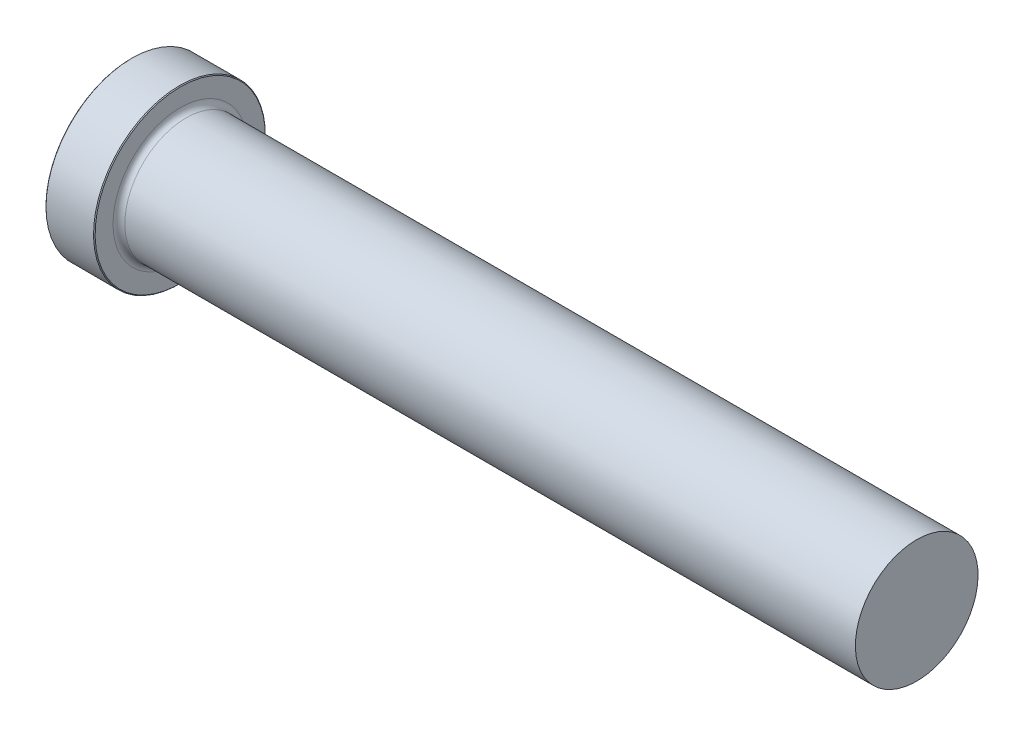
ISO-10303-21;
HEADER;
FILE_DESCRIPTION(('STEP AP214'),'2;1');
FILE_NAME('part.step','',(''),(''),'','','');
FILE_SCHEMA(('AUTOMOTIVE_DESIGN { 1 0 10303 214 1 1 1 1 }'));
ENDSEC;
DATA;
#1=APPLICATION_CONTEXT('core data for automotive mechanical design processes');
#2=APPLICATION_PROTOCOL_DEFINITION('international standard','automotive_design',2000,#1);
#3=PRODUCT_CONTEXT('',#1,'mechanical');
#4=PRODUCT('Part','Part','',(#3));
#5=PRODUCT_RELATED_PRODUCT_CATEGORY('part','',(#4));
#6=PRODUCT_DEFINITION_FORMATION('','',#4);
#7=PRODUCT_DEFINITION_CONTEXT('part definition',#1,'design');
#8=PRODUCT_DEFINITION('design','',#6,#7);
#9=PRODUCT_DEFINITION_SHAPE('','',#8);
#10=(LENGTH_UNIT() NAMED_UNIT(*) SI_UNIT(.MILLI.,.METRE.));
#11=(NAMED_UNIT(*) PLANE_ANGLE_UNIT() SI_UNIT($,.RADIAN.));
#12=(NAMED_UNIT(*) SI_UNIT($,.STERADIAN.) SOLID_ANGLE_UNIT());
#13=UNCERTAINTY_MEASURE_WITH_UNIT(LENGTH_MEASURE(1.E-05),#10,'distance_accuracy_value','');
#14=(GEOMETRIC_REPRESENTATION_CONTEXT(3) GLOBAL_UNCERTAINTY_ASSIGNED_CONTEXT((#13)) GLOBAL_UNIT_ASSIGNED_CONTEXT((#10,
#11,#12)) REPRESENTATION_CONTEXT('',''));
#15=CARTESIAN_POINT('',(0.,0.,0.));
#16=DIRECTION('',(0.,0.,1.));
#17=DIRECTION('',(1.,0.,0.));
#18=AXIS2_PLACEMENT_3D('',#15,#16,#17);
#19=CARTESIAN_POINT('',(101.6,7.93114999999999,0.));
#20=DIRECTION('',(1.,0.,0.));
#21=DIRECTION('',(0.,1.,0.));
#22=AXIS2_PLACEMENT_3D('',#19,#20,#21);
#23=PLANE('',#22);
#24=CARTESIAN_POINT('',(101.6,0.,0.));
#25=DIRECTION('',(1.,0.,0.));
#26=DIRECTION('',(0.,1.,0.));
#27=AXIS2_PLACEMENT_3D('',#24,#25,#26);
#28=CIRCLE('',#27,7.93115);
#29=CARTESIAN_POINT('',(101.6,7.93114999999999,0.));
#30=VERTEX_POINT('',#29);
#31=EDGE_CURVE('E50',#30,#30,#28,.T.);
#32=ORIENTED_EDGE('',*,*,#31,.T.);
#33=EDGE_LOOP('',(#32));
#34=FACE_BOUND('',#33,.T.);
#35=ADVANCED_FACE('F30',(#34),#23,.T.);
#36=CARTESIAN_POINT('',(101.6,0.,0.));
#37=DIRECTION('',(1.,0.,0.));
#38=DIRECTION('',(0.,1.,0.));
#39=AXIS2_PLACEMENT_3D('',#36,#37,#38);
#40=CYLINDRICAL_SURFACE('',#39,7.93115);
#41=CARTESIAN_POINT('',(7.11199999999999,0.,0.));
#42=DIRECTION('',(1.,0.,0.));
#43=DIRECTION('',(0.,1.,0.));
#44=AXIS2_PLACEMENT_3D('',#41,#42,#43);
#45=CIRCLE('',#44,7.93115);
#46=CARTESIAN_POINT('',(7.11199999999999,7.93115,0.));
#47=VERTEX_POINT('',#46);
#48=EDGE_CURVE('E53',#47,#47,#45,.T.);
#49=ORIENTED_EDGE('',*,*,#48,.T.);
#50=EDGE_LOOP('',(#49));
#51=FACE_BOUND('',#50,.T.);
#52=ORIENTED_EDGE('',*,*,#31,.F.);
#53=EDGE_LOOP('',(#52));
#54=FACE_BOUND('',#53,.T.);
#55=ADVANCED_FACE('F74',(#51,#54),#40,.T.);
#56=CARTESIAN_POINT('',(7.112,0.,0.));
#57=DIRECTION('',(1.,0.,0.));
#58=DIRECTION('',(0.,1.,0.));
#59=AXIS2_PLACEMENT_3D('',#56,#57,#58);
#60=TOROIDAL_SURFACE('',#59,8.69315,0.761999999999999);
#61=CARTESIAN_POINT('',(6.34999999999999,0.,0.));
#62=DIRECTION('',(1.,0.,0.));
#63=DIRECTION('',(0.,1.,0.));
#64=AXIS2_PLACEMENT_3D('',#61,#62,#63);
#65=CIRCLE('',#64,8.69315);
#66=CARTESIAN_POINT('',(6.35,8.69315,0.));
#67=VERTEX_POINT('',#66);
#68=EDGE_CURVE('E56',#67,#67,#65,.T.);
#69=ORIENTED_EDGE('',*,*,#68,.T.);
#70=EDGE_LOOP('',(#69));
#71=FACE_BOUND('',#70,.T.);
#72=ORIENTED_EDGE('',*,*,#48,.F.);
#73=EDGE_LOOP('',(#72));
#74=FACE_BOUND('',#73,.T.);
#75=ADVANCED_FACE('F60',(#71,#74),#60,.F.);
#76=CARTESIAN_POINT('',(6.35,11.1125,0.));
#77=DIRECTION('',(1.,0.,0.));
#78=DIRECTION('',(0.,1.,0.));
#79=AXIS2_PLACEMENT_3D('',#76,#77,#78);
#80=PLANE('',#79);
#81=CARTESIAN_POINT('',(6.35,0.,0.));
#82=DIRECTION('',(1.,0.,0.));
#83=DIRECTION('',(0.,1.,0.));
#84=AXIS2_PLACEMENT_3D('',#81,#82,#83);
#85=CIRCLE('',#84,11.0109);
#86=CARTESIAN_POINT('',(6.35,11.0109,0.));
#87=VERTEX_POINT('',#86);
#88=EDGE_CURVE('E10',#87,#87,#85,.T.);
#89=ORIENTED_EDGE('',*,*,#88,.T.);
#90=EDGE_LOOP('',(#89));
#91=FACE_BOUND('',#90,.T.);
#92=ORIENTED_EDGE('',*,*,#68,.F.);
#93=EDGE_LOOP('',(#92));
#94=FACE_BOUND('',#93,.T.);
#95=ADVANCED_FACE('F63',(#91,#94),#80,.T.);
#96=CARTESIAN_POINT('',(101.6,0.,0.));
#97=DIRECTION('',(1.,0.,0.));
#98=DIRECTION('',(0.,1.,0.));
#99=AXIS2_PLACEMENT_3D('',#96,#97,#98);
#100=CYLINDRICAL_SURFACE('',#99,11.1125);
#101=CARTESIAN_POINT('',(0.101600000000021,0.,0.));
#102=DIRECTION('',(-1.,0.,0.));
#103=DIRECTION('',(0.,-1.,0.));
#104=AXIS2_PLACEMENT_3D('',#101,#102,#103);
#105=CIRCLE('',#104,11.1125);
#106=CARTESIAN_POINT('',(0.10160000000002,-11.1125,0.));
#107=VERTEX_POINT('',#106);
#108=EDGE_CURVE('E41',#107,#107,#105,.F.);
#109=ORIENTED_EDGE('',*,*,#108,.T.);
#110=EDGE_LOOP('',(#109));
#111=FACE_BOUND('',#110,.T.);
#112=CARTESIAN_POINT('',(6.2484,0.,0.));
#113=DIRECTION('',(1.,0.,0.));
#114=DIRECTION('',(0.,1.,0.));
#115=AXIS2_PLACEMENT_3D('',#112,#113,#114);
#116=CIRCLE('',#115,11.1125);
#117=CARTESIAN_POINT('',(6.2484,11.1125,0.));
#118=VERTEX_POINT('',#117);
#119=EDGE_CURVE('E45',#118,#118,#116,.F.);
#120=ORIENTED_EDGE('',*,*,#119,.T.);
#121=EDGE_LOOP('',(#120));
#122=FACE_BOUND('',#121,.T.);
#123=ADVANCED_FACE('F65',(#111,#122),#100,.T.);
#124=CARTESIAN_POINT('',(0.,0.,0.));
#125=DIRECTION('',(-1.,0.,0.));
#126=DIRECTION('',(0.,-1.,0.));
#127=AXIS2_PLACEMENT_3D('',#124,#125,#126);
#128=PLANE('',#127);
#129=CARTESIAN_POINT('',(0.,0.,0.));
#130=DIRECTION('',(-1.,0.,0.));
#131=DIRECTION('',(0.,-1.,0.));
#132=AXIS2_PLACEMENT_3D('',#129,#130,#131);
#133=CIRCLE('',#132,11.0109);
#134=CARTESIAN_POINT('',(0.,-11.0109,0.));
#135=VERTEX_POINT('',#134);
#136=EDGE_CURVE('E37',#135,#135,#133,.T.);
#137=ORIENTED_EDGE('',*,*,#136,.T.);
#138=EDGE_LOOP('',(#137));
#139=FACE_BOUND('',#138,.T.);
#140=ADVANCED_FACE('F71',(#139),#128,.T.);
#141=CARTESIAN_POINT('',(0.101600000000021,0.,0.));
#142=DIRECTION('',(1.,0.,0.));
#143=DIRECTION('',(0.,1.,0.));
#144=AXIS2_PLACEMENT_3D('',#141,#142,#143);
#145=CONICAL_SURFACE('',#144,11.1125,0.785398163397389);
#146=ORIENTED_EDGE('',*,*,#136,.F.);
#147=EDGE_LOOP('',(#146));
#148=FACE_BOUND('',#147,.T.);
#149=ORIENTED_EDGE('',*,*,#108,.F.);
#150=EDGE_LOOP('',(#149));
#151=FACE_BOUND('',#150,.T.);
#152=ADVANCED_FACE('F84',(#148,#151),#145,.T.);
#153=CARTESIAN_POINT('',(6.34999999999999,0.,0.));
#154=DIRECTION('',(-1.,0.,0.));
#155=DIRECTION('',(0.,-1.,0.));
#156=AXIS2_PLACEMENT_3D('',#153,#154,#155);
#157=CONICAL_SURFACE('',#156,11.0109,0.785398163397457);
#158=ORIENTED_EDGE('',*,*,#119,.F.);
#159=EDGE_LOOP('',(#158));
#160=FACE_BOUND('',#159,.T.);
#161=ORIENTED_EDGE('',*,*,#88,.F.);
#162=EDGE_LOOP('',(#161));
#163=FACE_BOUND('',#162,.T.);
#164=ADVANCED_FACE('F32',(#160,#163),#157,.T.);
#165=CLOSED_SHELL('',(#35,#55,#75,#95,#123,#140,#152,#164));
#166=MANIFOLD_SOLID_BREP('B2',#165);
#167=ADVANCED_BREP_SHAPE_REPRESENTATION('',(#18,#166),#14);
#168=SHAPE_DEFINITION_REPRESENTATION(#9,#167);
ENDSEC;
END-ISO-10303-21;
